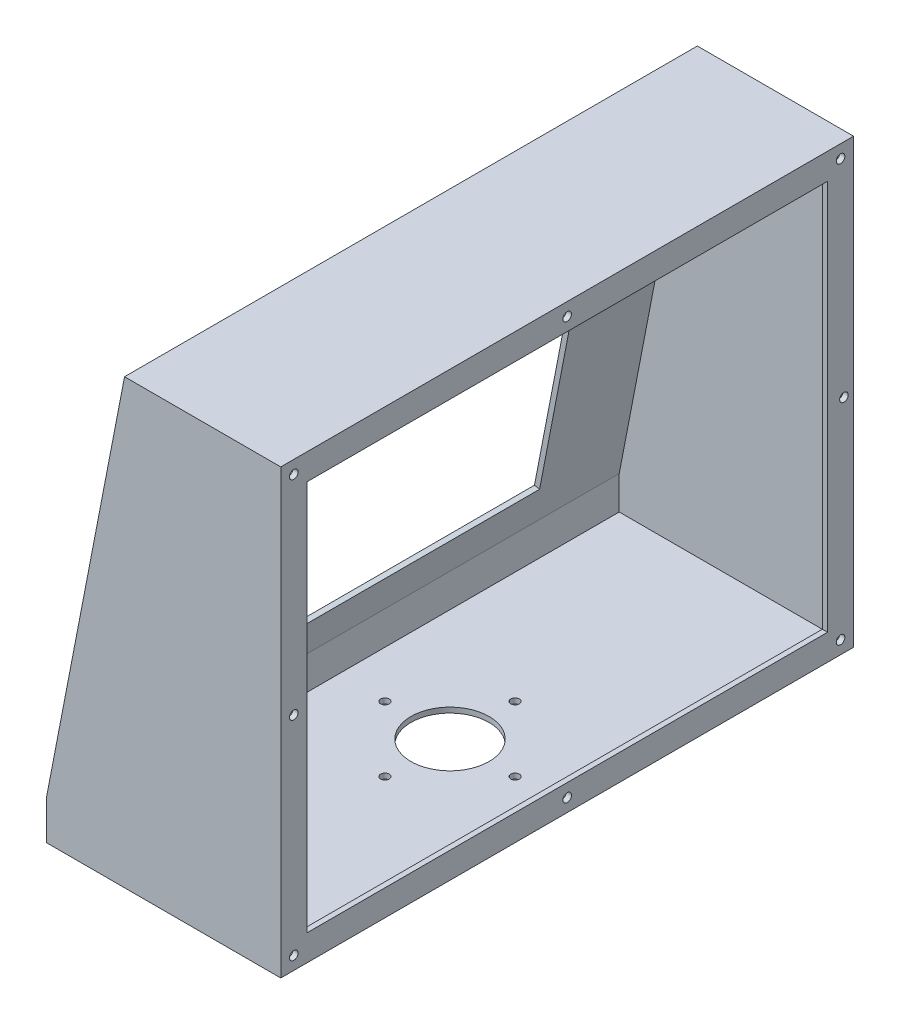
ISO-10303-21;
HEADER;
FILE_DESCRIPTION(('STEP AP214'),'2;1');
FILE_NAME('part.step','',(''),(''),'','','');
FILE_SCHEMA(('AUTOMOTIVE_DESIGN { 1 0 10303 214 1 1 1 1 }'));
ENDSEC;
DATA;
#1=APPLICATION_CONTEXT('core data for automotive mechanical design processes');
#2=APPLICATION_PROTOCOL_DEFINITION('international standard','automotive_design',2000,#1);
#3=PRODUCT_CONTEXT('',#1,'mechanical');
#4=PRODUCT('Part','Part','',(#3));
#5=PRODUCT_RELATED_PRODUCT_CATEGORY('part','',(#4));
#6=PRODUCT_DEFINITION_FORMATION('','',#4);
#7=PRODUCT_DEFINITION_CONTEXT('part definition',#1,'design');
#8=PRODUCT_DEFINITION('design','',#6,#7);
#9=PRODUCT_DEFINITION_SHAPE('','',#8);
#10=(LENGTH_UNIT() NAMED_UNIT(*) SI_UNIT(.MILLI.,.METRE.));
#11=(NAMED_UNIT(*) PLANE_ANGLE_UNIT() SI_UNIT($,.RADIAN.));
#12=(NAMED_UNIT(*) SI_UNIT($,.STERADIAN.) SOLID_ANGLE_UNIT());
#13=UNCERTAINTY_MEASURE_WITH_UNIT(LENGTH_MEASURE(1.E-05),#10,'distance_accuracy_value','');
#14=(GEOMETRIC_REPRESENTATION_CONTEXT(3) GLOBAL_UNCERTAINTY_ASSIGNED_CONTEXT((#13)) GLOBAL_UNIT_ASSIGNED_CONTEXT((#10,
#11,#12)) REPRESENTATION_CONTEXT('',''));
#15=CARTESIAN_POINT('',(0.,0.,0.));
#16=DIRECTION('',(0.,0.,1.));
#17=DIRECTION('',(1.,0.,0.));
#18=AXIS2_PLACEMENT_3D('',#15,#16,#17);
#19=CARTESIAN_POINT('',(0.,-10.,210.));
#20=DIRECTION('',(0.,0.,1.));
#21=DIRECTION('',(0.,-1.,0.));
#22=AXIS2_PLACEMENT_3D('',#19,#20,#21);
#23=PLANE('',#22);
#24=DIRECTION('',(0.,-1.,0.));
#25=VECTOR('',#24,1.);
#26=CARTESIAN_POINT('',(58.,-10.,210.));
#27=LINE('',#26,#25);
#28=CARTESIAN_POINT('',(58.,-10.,210.));
#29=VERTEX_POINT('',#28);
#30=CARTESIAN_POINT('',(58.,-160.,210.));
#31=VERTEX_POINT('',#30);
#32=EDGE_CURVE('E175',#29,#31,#27,.T.);
#33=ORIENTED_EDGE('',*,*,#32,.F.);
#34=DIRECTION('',(1.,0.,0.));
#35=VECTOR('',#34,1.);
#36=CARTESIAN_POINT('',(0.,-10.,210.));
#37=LINE('',#36,#35);
#38=CARTESIAN_POINT('',(60.,-10.,210.));
#39=VERTEX_POINT('',#38);
#40=EDGE_CURVE('E255',#29,#39,#37,.T.);
#41=ORIENTED_EDGE('',*,*,#40,.T.);
#42=DIRECTION('',(0.,-1.,0.));
#43=VECTOR('',#42,1.);
#44=CARTESIAN_POINT('',(60.,-10.,210.));
#45=LINE('',#44,#43);
#46=CARTESIAN_POINT('',(60.,-160.,210.));
#47=VERTEX_POINT('',#46);
#48=EDGE_CURVE('E206',#39,#47,#45,.T.);
#49=ORIENTED_EDGE('',*,*,#48,.T.);
#50=DIRECTION('',(1.,0.,0.));
#51=VECTOR('',#50,1.);
#52=CARTESIAN_POINT('',(0.,-160.,210.));
#53=LINE('',#52,#51);
#54=EDGE_CURVE('E254',#31,#47,#53,.T.);
#55=ORIENTED_EDGE('',*,*,#54,.F.);
#56=EDGE_LOOP('',(#33,#41,#49,#55));
#57=FACE_BOUND('',#56,.T.);
#58=ADVANCED_FACE('F34',(#57),#23,.F.);
#59=CARTESIAN_POINT('',(0.,-10.,210.));
#60=DIRECTION('',(0.,1.,0.));
#61=DIRECTION('',(0.,0.,1.));
#62=AXIS2_PLACEMENT_3D('',#59,#60,#61);
#63=PLANE('',#62);
#64=DIRECTION('',(0.,0.,1.));
#65=VECTOR('',#64,1.);
#66=CARTESIAN_POINT('',(58.,-10.,210.));
#67=LINE('',#66,#65);
#68=CARTESIAN_POINT('',(58.,-10.,9.99999999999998));
#69=VERTEX_POINT('',#68);
#70=EDGE_CURVE('E202',#69,#29,#67,.T.);
#71=ORIENTED_EDGE('',*,*,#70,.F.);
#72=DIRECTION('',(1.,0.,0.));
#73=VECTOR('',#72,1.);
#74=CARTESIAN_POINT('',(0.,-10.,9.99999999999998));
#75=LINE('',#74,#73);
#76=CARTESIAN_POINT('',(60.,-10.,9.99999999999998));
#77=VERTEX_POINT('',#76);
#78=EDGE_CURVE('E258',#69,#77,#75,.T.);
#79=ORIENTED_EDGE('',*,*,#78,.T.);
#80=DIRECTION('',(0.,0.,1.));
#81=VECTOR('',#80,1.);
#82=CARTESIAN_POINT('',(60.,-10.,210.));
#83=LINE('',#82,#81);
#84=EDGE_CURVE('E251',#77,#39,#83,.T.);
#85=ORIENTED_EDGE('',*,*,#84,.T.);
#86=ORIENTED_EDGE('',*,*,#40,.F.);
#87=EDGE_LOOP('',(#71,#79,#85,#86));
#88=FACE_BOUND('',#87,.T.);
#89=ADVANCED_FACE('F394',(#88),#63,.F.);
#90=CARTESIAN_POINT('',(0.,-10.,9.99999999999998));
#91=DIRECTION('',(0.,0.,-1.));
#92=DIRECTION('',(0.,1.,0.));
#93=AXIS2_PLACEMENT_3D('',#90,#91,#92);
#94=PLANE('',#93);
#95=DIRECTION('',(0.,1.,0.));
#96=VECTOR('',#95,1.);
#97=CARTESIAN_POINT('',(58.,-10.,9.99999999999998));
#98=LINE('',#97,#96);
#99=CARTESIAN_POINT('',(58.,-160.,9.99999999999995));
#100=VERTEX_POINT('',#99);
#101=EDGE_CURVE('E239',#100,#69,#98,.T.);
#102=ORIENTED_EDGE('',*,*,#101,.F.);
#103=DIRECTION('',(1.,0.,0.));
#104=VECTOR('',#103,1.);
#105=CARTESIAN_POINT('',(0.,-160.,9.99999999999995));
#106=LINE('',#105,#104);
#107=CARTESIAN_POINT('',(60.,-160.,9.99999999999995));
#108=VERTEX_POINT('',#107);
#109=EDGE_CURVE('E260',#100,#108,#106,.T.);
#110=ORIENTED_EDGE('',*,*,#109,.T.);
#111=DIRECTION('',(0.,1.,0.));
#112=VECTOR('',#111,1.);
#113=CARTESIAN_POINT('',(60.,-10.,9.99999999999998));
#114=LINE('',#113,#112);
#115=EDGE_CURVE('E248',#108,#77,#114,.T.);
#116=ORIENTED_EDGE('',*,*,#115,.T.);
#117=ORIENTED_EDGE('',*,*,#78,.F.);
#118=EDGE_LOOP('',(#102,#110,#116,#117));
#119=FACE_BOUND('',#118,.T.);
#120=ADVANCED_FACE('F400',(#119),#94,.F.);
#121=CARTESIAN_POINT('',(0.,-160.,210.));
#122=DIRECTION('',(0.,-1.,0.));
#123=DIRECTION('',(0.,0.,-1.));
#124=AXIS2_PLACEMENT_3D('',#121,#122,#123);
#125=PLANE('',#124);
#126=DIRECTION('',(0.,0.,-1.));
#127=VECTOR('',#126,1.);
#128=CARTESIAN_POINT('',(58.,-160.,210.));
#129=LINE('',#128,#127);
#130=EDGE_CURVE('E237',#31,#100,#129,.T.);
#131=ORIENTED_EDGE('',*,*,#130,.F.);
#132=ORIENTED_EDGE('',*,*,#54,.T.);
#133=DIRECTION('',(0.,0.,-1.));
#134=VECTOR('',#133,1.);
#135=CARTESIAN_POINT('',(60.,-160.,210.));
#136=LINE('',#135,#134);
#137=EDGE_CURVE('E245',#47,#108,#136,.T.);
#138=ORIENTED_EDGE('',*,*,#137,.T.);
#139=ORIENTED_EDGE('',*,*,#109,.F.);
#140=EDGE_LOOP('',(#131,#132,#138,#139));
#141=FACE_BOUND('',#140,.T.);
#142=ADVANCED_FACE('F391',(#141),#125,.F.);
#143=CARTESIAN_POINT('',(60.,0.,220.));
#144=DIRECTION('',(0.,-1.,0.));
#145=DIRECTION('',(1.,0.,0.));
#146=AXIS2_PLACEMENT_3D('',#143,#144,#145);
#147=PLANE('',#146);
#148=DIRECTION('',(-1.,0.,0.));
#149=VECTOR('',#148,1.);
#150=CARTESIAN_POINT('',(60.,0.,0.));
#151=LINE('',#150,#149);
#152=CARTESIAN_POINT('',(60.,0.,0.));
#153=VERTEX_POINT('',#152);
#154=CARTESIAN_POINT('',(0.,0.,0.));
#155=VERTEX_POINT('',#154);
#156=EDGE_CURVE('E257',#153,#155,#151,.T.);
#157=ORIENTED_EDGE('',*,*,#156,.T.);
#158=DIRECTION('',(0.,0.,-1.));
#159=VECTOR('',#158,1.);
#160=CARTESIAN_POINT('',(0.,0.,220.));
#161=LINE('',#160,#159);
#162=CARTESIAN_POINT('',(0.,0.,220.));
#163=VERTEX_POINT('',#162);
#164=EDGE_CURVE('E11',#163,#155,#161,.T.);
#165=ORIENTED_EDGE('',*,*,#164,.F.);
#166=DIRECTION('',(-1.,0.,0.));
#167=VECTOR('',#166,1.);
#168=CARTESIAN_POINT('',(60.,0.,220.));
#169=LINE('',#168,#167);
#170=CARTESIAN_POINT('',(60.,0.,220.));
#171=VERTEX_POINT('',#170);
#172=EDGE_CURVE('E263',#171,#163,#169,.T.);
#173=ORIENTED_EDGE('',*,*,#172,.F.);
#174=DIRECTION('',(0.,0.,-1.));
#175=VECTOR('',#174,1.);
#176=CARTESIAN_POINT('',(60.,0.,220.));
#177=LINE('',#176,#175);
#178=EDGE_CURVE('E275',#171,#153,#177,.T.);
#179=ORIENTED_EDGE('',*,*,#178,.T.);
#180=EDGE_LOOP('',(#157,#165,#173,#179));
#181=FACE_BOUND('',#180,.T.);
#182=ADVANCED_FACE('F36',(#181),#147,.F.);
#183=CARTESIAN_POINT('',(0.,0.,220.));
#184=DIRECTION('',(0.981779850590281,-0.190021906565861,0.));
#185=DIRECTION('',(0.190021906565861,0.981779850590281,0.));
#186=AXIS2_PLACEMENT_3D('',#183,#184,#185);
#187=PLANE('',#186);
#188=CARTESIAN_POINT('',(-5.70065719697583,-29.4533955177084,15.));
#189=DIRECTION('',(0.981779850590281,-0.190021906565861,0.));
#190=DIRECTION('',(0.190021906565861,0.981779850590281,0.));
#191=AXIS2_PLACEMENT_3D('',#188,#189,#190);
#192=CIRCLE('',#191,8.00000000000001);
#193=CARTESIAN_POINT('',(-4.18048194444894,-21.5991567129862,15.));
#194=VERTEX_POINT('',#193);
#195=EDGE_CURVE('E376',#194,#194,#192,.F.);
#196=ORIENTED_EDGE('',*,*,#195,.F.);
#197=EDGE_LOOP('',(#196));
#198=FACE_BOUND('',#197,.T.);
#199=DIRECTION('',(0.,0.,1.));
#200=VECTOR('',#199,1.);
#201=CARTESIAN_POINT('',(-27.5531764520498,-142.358078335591,35.));
#202=LINE('',#201,#200);
#203=CARTESIAN_POINT('',(-27.5531764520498,-142.358078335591,35.));
#204=VERTEX_POINT('',#203);
#205=CARTESIAN_POINT('',(-27.5531764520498,-142.358078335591,192.));
#206=VERTEX_POINT('',#205);
#207=EDGE_CURVE('E181',#204,#206,#202,.T.);
#208=ORIENTED_EDGE('',*,*,#207,.F.);
#209=DIRECTION('',(-0.190021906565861,-0.981779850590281,0.));
#210=VECTOR('',#209,1.);
#211=CARTESIAN_POINT('',(-3.80043813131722,-19.6355970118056,35.));
#212=LINE('',#211,#210);
#213=CARTESIAN_POINT('',(-3.80043813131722,-19.6355970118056,35.));
#214=VERTEX_POINT('',#213);
#215=EDGE_CURVE('E163',#214,#204,#212,.T.);
#216=ORIENTED_EDGE('',*,*,#215,.F.);
#217=DIRECTION('',(0.,0.,-1.));
#218=VECTOR('',#217,1.);
#219=CARTESIAN_POINT('',(-3.80043813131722,-19.6355970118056,35.));
#220=LINE('',#219,#218);
#221=CARTESIAN_POINT('',(-3.80043813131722,-19.6355970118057,192.));
#222=VERTEX_POINT('',#221);
#223=EDGE_CURVE('E172',#222,#214,#220,.T.);
#224=ORIENTED_EDGE('',*,*,#223,.F.);
#225=DIRECTION('',(0.190021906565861,0.981779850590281,0.));
#226=VECTOR('',#225,1.);
#227=CARTESIAN_POINT('',(-3.80043813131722,-19.6355970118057,192.));
#228=LINE('',#227,#226);
#229=EDGE_CURVE('E51',#206,#222,#228,.T.);
#230=ORIENTED_EDGE('',*,*,#229,.F.);
#231=EDGE_LOOP('',(#208,#216,#224,#230));
#232=FACE_BOUND('',#231,.T.);
#233=DIRECTION('',(-0.190021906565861,-0.981779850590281,0.));
#234=VECTOR('',#233,1.);
#235=CARTESIAN_POINT('',(0.,0.,0.));
#236=LINE('',#235,#234);
#237=CARTESIAN_POINT('',(-30.,-155.,0.));
#238=VERTEX_POINT('',#237);
#239=EDGE_CURVE('E278',#155,#238,#236,.T.);
#240=ORIENTED_EDGE('',*,*,#239,.T.);
#241=DIRECTION('',(0.,0.,-1.));
#242=VECTOR('',#241,1.);
#243=CARTESIAN_POINT('',(-30.,-155.,220.));
#244=LINE('',#243,#242);
#245=CARTESIAN_POINT('',(-30.,-155.,220.));
#246=VERTEX_POINT('',#245);
#247=EDGE_CURVE('E43',#246,#238,#244,.T.);
#248=ORIENTED_EDGE('',*,*,#247,.F.);
#249=DIRECTION('',(-0.190021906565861,-0.981779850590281,0.));
#250=VECTOR('',#249,1.);
#251=CARTESIAN_POINT('',(0.,0.,220.));
#252=LINE('',#251,#250);
#253=EDGE_CURVE('E266',#163,#246,#252,.T.);
#254=ORIENTED_EDGE('',*,*,#253,.F.);
#255=ORIENTED_EDGE('',*,*,#164,.T.);
#256=EDGE_LOOP('',(#240,#248,#254,#255));
#257=FACE_BOUND('',#256,.T.);
#258=ADVANCED_FACE('F178',(#198,#232,#257),#187,.F.);
#259=CARTESIAN_POINT('',(-30.,-155.,220.));
#260=DIRECTION('',(1.,0.,0.));
#261=DIRECTION('',(0.,1.,0.));
#262=AXIS2_PLACEMENT_3D('',#259,#260,#261);
#263=PLANE('',#262);
#264=DIRECTION('',(0.,-1.,0.));
#265=VECTOR('',#264,1.);
#266=CARTESIAN_POINT('',(-30.,-155.,0.));
#267=LINE('',#266,#265);
#268=CARTESIAN_POINT('',(-30.,-170.,0.));
#269=VERTEX_POINT('',#268);
#270=EDGE_CURVE('E280',#238,#269,#267,.T.);
#271=ORIENTED_EDGE('',*,*,#270,.T.);
#272=DIRECTION('',(0.,0.,-1.));
#273=VECTOR('',#272,1.);
#274=CARTESIAN_POINT('',(-30.,-170.,220.));
#275=LINE('',#274,#273);
#276=CARTESIAN_POINT('',(-30.,-170.,220.));
#277=VERTEX_POINT('',#276);
#278=EDGE_CURVE('E290',#277,#269,#275,.T.);
#279=ORIENTED_EDGE('',*,*,#278,.F.);
#280=DIRECTION('',(0.,-1.,0.));
#281=VECTOR('',#280,1.);
#282=CARTESIAN_POINT('',(-30.,-155.,220.));
#283=LINE('',#282,#281);
#284=EDGE_CURVE('E269',#246,#277,#283,.T.);
#285=ORIENTED_EDGE('',*,*,#284,.F.);
#286=ORIENTED_EDGE('',*,*,#247,.T.);
#287=EDGE_LOOP('',(#271,#279,#285,#286));
#288=FACE_BOUND('',#287,.T.);
#289=ADVANCED_FACE('F383',(#288),#263,.F.);
#290=CARTESIAN_POINT('',(-30.,-170.,220.));
#291=DIRECTION('',(0.,1.,0.));
#292=DIRECTION('',(0.,0.,1.));
#293=AXIS2_PLACEMENT_3D('',#290,#291,#292);
#294=PLANE('',#293);
#295=CARTESIAN_POINT('',(-10.,-170.,110.));
#296=DIRECTION('',(0.,1.,0.));
#297=DIRECTION('',(0.,0.,1.));
#298=AXIS2_PLACEMENT_3D('',#295,#296,#297);
#299=CIRCLE('',#298,1.65);
#300=CARTESIAN_POINT('',(-10.,-170.,111.65));
#301=VERTEX_POINT('',#300);
#302=EDGE_CURVE('E346',#301,#301,#299,.T.);
#303=ORIENTED_EDGE('',*,*,#302,.T.);
#304=EDGE_LOOP('',(#303));
#305=FACE_BOUND('',#304,.T.);
#306=CARTESIAN_POINT('',(15.,-170.,135.));
#307=DIRECTION('',(0.,1.,0.));
#308=DIRECTION('',(0.,0.,1.));
#309=AXIS2_PLACEMENT_3D('',#306,#307,#308);
#310=CIRCLE('',#309,1.65);
#311=CARTESIAN_POINT('',(15.,-170.,136.65));
#312=VERTEX_POINT('',#311);
#313=EDGE_CURVE('E352',#312,#312,#310,.T.);
#314=ORIENTED_EDGE('',*,*,#313,.T.);
#315=EDGE_LOOP('',(#314));
#316=FACE_BOUND('',#315,.T.);
#317=CARTESIAN_POINT('',(15.,-170.,85.));
#318=DIRECTION('',(0.,1.,0.));
#319=DIRECTION('',(0.,0.,1.));
#320=AXIS2_PLACEMENT_3D('',#317,#318,#319);
#321=CIRCLE('',#320,1.65);
#322=CARTESIAN_POINT('',(15.,-170.,86.65));
#323=VERTEX_POINT('',#322);
#324=EDGE_CURVE('E358',#323,#323,#321,.T.);
#325=ORIENTED_EDGE('',*,*,#324,.T.);
#326=EDGE_LOOP('',(#325));
#327=FACE_BOUND('',#326,.T.);
#328=CARTESIAN_POINT('',(40.,-170.,110.));
#329=DIRECTION('',(0.,1.,0.));
#330=DIRECTION('',(0.,0.,1.));
#331=AXIS2_PLACEMENT_3D('',#328,#329,#330);
#332=CIRCLE('',#331,1.65);
#333=CARTESIAN_POINT('',(40.,-170.,111.65));
#334=VERTEX_POINT('',#333);
#335=EDGE_CURVE('E364',#334,#334,#332,.T.);
#336=ORIENTED_EDGE('',*,*,#335,.T.);
#337=EDGE_LOOP('',(#336));
#338=FACE_BOUND('',#337,.T.);
#339=CARTESIAN_POINT('',(15.,-170.,110.));
#340=DIRECTION('',(0.,-1.,0.));
#341=DIRECTION('',(0.,0.,-1.));
#342=AXIS2_PLACEMENT_3D('',#339,#340,#341);
#343=CIRCLE('',#342,15.);
#344=CARTESIAN_POINT('',(15.,-170.,95.));
#345=VERTEX_POINT('',#344);
#346=EDGE_CURVE('E367',#345,#345,#343,.T.);
#347=ORIENTED_EDGE('',*,*,#346,.F.);
#348=EDGE_LOOP('',(#347));
#349=FACE_BOUND('',#348,.T.);
#350=DIRECTION('',(1.,0.,0.));
#351=VECTOR('',#350,1.);
#352=CARTESIAN_POINT('',(-30.,-170.,0.));
#353=LINE('',#352,#351);
#354=CARTESIAN_POINT('',(60.,-170.,0.));
#355=VERTEX_POINT('',#354);
#356=EDGE_CURVE('E282',#269,#355,#353,.T.);
#357=ORIENTED_EDGE('',*,*,#356,.T.);
#358=DIRECTION('',(0.,0.,-1.));
#359=VECTOR('',#358,1.);
#360=CARTESIAN_POINT('',(60.,-170.,220.));
#361=LINE('',#360,#359);
#362=CARTESIAN_POINT('',(60.,-170.,220.));
#363=VERTEX_POINT('',#362);
#364=EDGE_CURVE('E287',#363,#355,#361,.T.);
#365=ORIENTED_EDGE('',*,*,#364,.F.);
#366=DIRECTION('',(1.,0.,0.));
#367=VECTOR('',#366,1.);
#368=CARTESIAN_POINT('',(-30.,-170.,220.));
#369=LINE('',#368,#367);
#370=EDGE_CURVE('E271',#277,#363,#369,.T.);
#371=ORIENTED_EDGE('',*,*,#370,.F.);
#372=ORIENTED_EDGE('',*,*,#278,.T.);
#373=EDGE_LOOP('',(#357,#365,#371,#372));
#374=FACE_BOUND('',#373,.T.);
#375=ADVANCED_FACE('F388',(#305,#316,#327,#338,#349,#374),#294,.F.);
#376=CARTESIAN_POINT('',(60.,-170.,220.));
#377=DIRECTION('',(-1.,0.,0.));
#378=DIRECTION('',(0.,0.,1.));
#379=AXIS2_PLACEMENT_3D('',#376,#377,#378);
#380=PLANE('',#379);
#381=CARTESIAN_POINT('',(60.,-5.,215.));
#382=DIRECTION('',(1.,0.,0.));
#383=DIRECTION('',(0.,0.,-1.));
#384=AXIS2_PLACEMENT_3D('',#381,#382,#383);
#385=CIRCLE('',#384,1.65);
#386=CARTESIAN_POINT('',(60.,-5.,213.35));
#387=VERTEX_POINT('',#386);
#388=EDGE_CURVE('E311',#387,#387,#385,.T.);
#389=ORIENTED_EDGE('',*,*,#388,.F.);
#390=EDGE_LOOP('',(#389));
#391=FACE_BOUND('',#390,.T.);
#392=CARTESIAN_POINT('',(60.,-85.,215.));
#393=DIRECTION('',(1.,0.,0.));
#394=DIRECTION('',(0.,0.,-1.));
#395=AXIS2_PLACEMENT_3D('',#392,#393,#394);
#396=CIRCLE('',#395,1.65);
#397=CARTESIAN_POINT('',(60.,-85.,213.35));
#398=VERTEX_POINT('',#397);
#399=EDGE_CURVE('E301',#398,#398,#396,.T.);
#400=ORIENTED_EDGE('',*,*,#399,.F.);
#401=EDGE_LOOP('',(#400));
#402=FACE_BOUND('',#401,.T.);
#403=CARTESIAN_POINT('',(60.,-165.,215.));
#404=DIRECTION('',(1.,0.,0.));
#405=DIRECTION('',(0.,0.,-1.));
#406=AXIS2_PLACEMENT_3D('',#403,#404,#405);
#407=CIRCLE('',#406,1.64999999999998);
#408=CARTESIAN_POINT('',(60.,-165.,213.35));
#409=VERTEX_POINT('',#408);
#410=EDGE_CURVE('E298',#409,#409,#407,.T.);
#411=ORIENTED_EDGE('',*,*,#410,.F.);
#412=EDGE_LOOP('',(#411));
#413=FACE_BOUND('',#412,.T.);
#414=CARTESIAN_POINT('',(60.,-165.,110.));
#415=DIRECTION('',(1.,0.,0.));
#416=DIRECTION('',(0.,0.,-1.));
#417=AXIS2_PLACEMENT_3D('',#414,#415,#416);
#418=CIRCLE('',#417,1.64999999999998);
#419=CARTESIAN_POINT('',(60.,-165.,108.35));
#420=VERTEX_POINT('',#419);
#421=EDGE_CURVE('E297',#420,#420,#418,.T.);
#422=ORIENTED_EDGE('',*,*,#421,.F.);
#423=EDGE_LOOP('',(#422));
#424=FACE_BOUND('',#423,.T.);
#425=CARTESIAN_POINT('',(60.,-165.,5.));
#426=DIRECTION('',(1.,0.,0.));
#427=DIRECTION('',(0.,0.,-1.));
#428=AXIS2_PLACEMENT_3D('',#425,#426,#427);
#429=CIRCLE('',#428,1.64999999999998);
#430=CARTESIAN_POINT('',(60.,-165.,3.35000000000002));
#431=VERTEX_POINT('',#430);
#432=EDGE_CURVE('E319',#431,#431,#429,.T.);
#433=ORIENTED_EDGE('',*,*,#432,.F.);
#434=EDGE_LOOP('',(#433));
#435=FACE_BOUND('',#434,.T.);
#436=CARTESIAN_POINT('',(60.,-85.,3.69391633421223));
#437=DIRECTION('',(1.,0.,0.));
#438=DIRECTION('',(0.,0.,-1.));
#439=AXIS2_PLACEMENT_3D('',#436,#437,#438);
#440=CIRCLE('',#439,1.65);
#441=CARTESIAN_POINT('',(60.,-85.,2.04391633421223));
#442=VERTEX_POINT('',#441);
#443=EDGE_CURVE('E325',#442,#442,#440,.T.);
#444=ORIENTED_EDGE('',*,*,#443,.F.);
#445=EDGE_LOOP('',(#444));
#446=FACE_BOUND('',#445,.T.);
#447=CARTESIAN_POINT('',(60.,-5.,5.));
#448=DIRECTION('',(1.,0.,0.));
#449=DIRECTION('',(0.,0.,-1.));
#450=AXIS2_PLACEMENT_3D('',#447,#448,#449);
#451=CIRCLE('',#450,1.65);
#452=CARTESIAN_POINT('',(60.,-5.,3.35000000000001));
#453=VERTEX_POINT('',#452);
#454=EDGE_CURVE('E331',#453,#453,#451,.T.);
#455=ORIENTED_EDGE('',*,*,#454,.F.);
#456=EDGE_LOOP('',(#455));
#457=FACE_BOUND('',#456,.T.);
#458=CARTESIAN_POINT('',(60.,-5.,110.));
#459=DIRECTION('',(1.,0.,0.));
#460=DIRECTION('',(0.,0.,-1.));
#461=AXIS2_PLACEMENT_3D('',#458,#459,#460);
#462=CIRCLE('',#461,1.65);
#463=CARTESIAN_POINT('',(60.,-5.,108.35));
#464=VERTEX_POINT('',#463);
#465=EDGE_CURVE('E337',#464,#464,#462,.T.);
#466=ORIENTED_EDGE('',*,*,#465,.F.);
#467=EDGE_LOOP('',(#466));
#468=FACE_BOUND('',#467,.T.);
#469=ORIENTED_EDGE('',*,*,#137,.F.);
#470=ORIENTED_EDGE('',*,*,#48,.F.);
#471=ORIENTED_EDGE('',*,*,#84,.F.);
#472=ORIENTED_EDGE('',*,*,#115,.F.);
#473=EDGE_LOOP('',(#469,#470,#471,#472));
#474=FACE_BOUND('',#473,.T.);
#475=DIRECTION('',(0.,1.,0.));
#476=VECTOR('',#475,1.);
#477=CARTESIAN_POINT('',(60.,-170.,0.));
#478=LINE('',#477,#476);
#479=EDGE_CURVE('E267',#355,#153,#478,.T.);
#480=ORIENTED_EDGE('',*,*,#479,.T.);
#481=ORIENTED_EDGE('',*,*,#178,.F.);
#482=DIRECTION('',(0.,1.,0.));
#483=VECTOR('',#482,1.);
#484=CARTESIAN_POINT('',(60.,-170.,220.));
#485=LINE('',#484,#483);
#486=EDGE_CURVE('E273',#363,#171,#485,.T.);
#487=ORIENTED_EDGE('',*,*,#486,.F.);
#488=ORIENTED_EDGE('',*,*,#364,.T.);
#489=EDGE_LOOP('',(#480,#481,#487,#488));
#490=FACE_BOUND('',#489,.T.);
#491=ADVANCED_FACE('F411',(#391,#402,#413,#424,#435,#446,#457,#468,#474,#490),#380,.F.);
#492=CARTESIAN_POINT('',(-30.,0.,220.));
#493=DIRECTION('',(0.,0.,1.));
#494=DIRECTION('',(1.,0.,0.));
#495=AXIS2_PLACEMENT_3D('',#492,#493,#494);
#496=PLANE('',#495);
#497=ORIENTED_EDGE('',*,*,#172,.T.);
#498=ORIENTED_EDGE('',*,*,#253,.T.);
#499=ORIENTED_EDGE('',*,*,#284,.T.);
#500=ORIENTED_EDGE('',*,*,#370,.T.);
#501=ORIENTED_EDGE('',*,*,#486,.T.);
#502=EDGE_LOOP('',(#497,#498,#499,#500,#501));
#503=FACE_BOUND('',#502,.T.);
#504=ADVANCED_FACE('F407',(#503),#496,.T.);
#505=CARTESIAN_POINT('',(-30.,0.,0.));
#506=DIRECTION('',(0.,0.,1.));
#507=DIRECTION('',(1.,0.,0.));
#508=AXIS2_PLACEMENT_3D('',#505,#506,#507);
#509=PLANE('',#508);
#510=ORIENTED_EDGE('',*,*,#156,.F.);
#511=ORIENTED_EDGE('',*,*,#479,.F.);
#512=ORIENTED_EDGE('',*,*,#356,.F.);
#513=ORIENTED_EDGE('',*,*,#270,.F.);
#514=ORIENTED_EDGE('',*,*,#239,.F.);
#515=EDGE_LOOP('',(#510,#511,#512,#513,#514));
#516=FACE_BOUND('',#515,.T.);
#517=ADVANCED_FACE('F410',(#516),#509,.F.);
#518=CARTESIAN_POINT('',(60.,-2.,220.));
#519=DIRECTION('',(0.,-1.,0.));
#520=DIRECTION('',(1.,0.,0.));
#521=AXIS2_PLACEMENT_3D('',#518,#519,#520);
#522=PLANE('',#521);
#523=DIRECTION('',(-1.,0.,0.));
#524=VECTOR('',#523,1.);
#525=CARTESIAN_POINT('',(60.,-2.,2.));
#526=LINE('',#525,#524);
#527=CARTESIAN_POINT('',(58.,-2.,2.));
#528=VERTEX_POINT('',#527);
#529=CARTESIAN_POINT('',(1.65001979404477,-2.,2.));
#530=VERTEX_POINT('',#529);
#531=EDGE_CURVE('E198',#528,#530,#526,.T.);
#532=ORIENTED_EDGE('',*,*,#531,.F.);
#533=DIRECTION('',(0.,0.,-1.));
#534=VECTOR('',#533,1.);
#535=CARTESIAN_POINT('',(58.,-2.,220.));
#536=LINE('',#535,#534);
#537=CARTESIAN_POINT('',(58.,-2.,218.));
#538=VERTEX_POINT('',#537);
#539=EDGE_CURVE('E213',#538,#528,#536,.T.);
#540=ORIENTED_EDGE('',*,*,#539,.F.);
#541=DIRECTION('',(-1.,0.,0.));
#542=VECTOR('',#541,1.);
#543=CARTESIAN_POINT('',(60.,-2.,218.));
#544=LINE('',#543,#542);
#545=CARTESIAN_POINT('',(1.65001979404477,-2.,218.));
#546=VERTEX_POINT('',#545);
#547=EDGE_CURVE('E208',#538,#546,#544,.T.);
#548=ORIENTED_EDGE('',*,*,#547,.T.);
#549=DIRECTION('',(0.,0.,-1.));
#550=VECTOR('',#549,1.);
#551=CARTESIAN_POINT('',(1.65001979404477,-2.,220.));
#552=LINE('',#551,#550);
#553=EDGE_CURVE('E203',#546,#530,#552,.T.);
#554=ORIENTED_EDGE('',*,*,#553,.T.);
#555=EDGE_LOOP('',(#532,#540,#548,#554));
#556=FACE_BOUND('',#555,.T.);
#557=ADVANCED_FACE('F415',(#556),#522,.T.);
#558=CARTESIAN_POINT('',(1.96355970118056,-0.380043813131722,220.));
#559=DIRECTION('',(0.981779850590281,-0.190021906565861,0.));
#560=DIRECTION('',(0.190021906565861,0.981779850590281,0.));
#561=AXIS2_PLACEMENT_3D('',#558,#559,#560);
#562=PLANE('',#561);
#563=CARTESIAN_POINT('',(-3.73709749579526,-29.8334393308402,15.));
#564=DIRECTION('',(0.981779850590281,-0.190021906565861,0.));
#565=DIRECTION('',(0.190021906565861,0.981779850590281,0.));
#566=AXIS2_PLACEMENT_3D('',#563,#564,#565);
#567=CIRCLE('',#566,8.00000000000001);
#568=CARTESIAN_POINT('',(-2.21692224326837,-21.9792005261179,15.));
#569=VERTEX_POINT('',#568);
#570=EDGE_CURVE('E371',#569,#569,#567,.T.);
#571=ORIENTED_EDGE('',*,*,#570,.F.);
#572=EDGE_LOOP('',(#571));
#573=FACE_BOUND('',#572,.T.);
#574=DIRECTION('',(0.190021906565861,0.981779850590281,0.));
#575=VECTOR('',#574,1.);
#576=CARTESIAN_POINT('',(-1.83687843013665,-20.0156408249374,35.));
#577=LINE('',#576,#575);
#578=CARTESIAN_POINT('',(-25.5896167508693,-142.738122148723,35.));
#579=VERTEX_POINT('',#578);
#580=CARTESIAN_POINT('',(-1.83687843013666,-20.0156408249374,35.));
#581=VERTEX_POINT('',#580);
#582=EDGE_CURVE('E59',#579,#581,#577,.T.);
#583=ORIENTED_EDGE('',*,*,#582,.F.);
#584=DIRECTION('',(0.,0.,-1.));
#585=VECTOR('',#584,1.);
#586=CARTESIAN_POINT('',(-25.5896167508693,-142.738122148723,35.));
#587=LINE('',#586,#585);
#588=CARTESIAN_POINT('',(-25.5896167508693,-142.738122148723,192.));
#589=VERTEX_POINT('',#588);
#590=EDGE_CURVE('E169',#589,#579,#587,.T.);
#591=ORIENTED_EDGE('',*,*,#590,.F.);
#592=DIRECTION('',(-0.190021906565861,-0.981779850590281,0.));
#593=VECTOR('',#592,1.);
#594=CARTESIAN_POINT('',(-1.83687843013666,-20.0156408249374,192.));
#595=LINE('',#594,#593);
#596=CARTESIAN_POINT('',(-1.83687843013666,-20.0156408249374,192.));
#597=VERTEX_POINT('',#596);
#598=EDGE_CURVE('E189',#597,#589,#595,.T.);
#599=ORIENTED_EDGE('',*,*,#598,.F.);
#600=DIRECTION('',(0.,0.,1.));
#601=VECTOR('',#600,1.);
#602=CARTESIAN_POINT('',(-1.83687843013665,-20.0156408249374,35.));
#603=LINE('',#602,#601);
#604=EDGE_CURVE('E183',#581,#597,#603,.T.);
#605=ORIENTED_EDGE('',*,*,#604,.F.);
#606=EDGE_LOOP('',(#583,#591,#599,#605));
#607=FACE_BOUND('',#606,.T.);
#608=DIRECTION('',(-0.190021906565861,-0.981779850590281,0.));
#609=VECTOR('',#608,1.);
#610=CARTESIAN_POINT('',(1.96355970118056,-0.380043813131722,2.));
#611=LINE('',#610,#609);
#612=CARTESIAN_POINT('',(-28.,-155.191768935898,2.));
#613=VERTEX_POINT('',#612);
#614=EDGE_CURVE('E201',#530,#613,#611,.T.);
#615=ORIENTED_EDGE('',*,*,#614,.F.);
#616=ORIENTED_EDGE('',*,*,#553,.F.);
#617=DIRECTION('',(-0.190021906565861,-0.981779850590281,0.));
#618=VECTOR('',#617,1.);
#619=CARTESIAN_POINT('',(1.96355970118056,-0.380043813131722,218.));
#620=LINE('',#619,#618);
#621=CARTESIAN_POINT('',(-28.,-155.191768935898,218.));
#622=VERTEX_POINT('',#621);
#623=EDGE_CURVE('E211',#546,#622,#620,.T.);
#624=ORIENTED_EDGE('',*,*,#623,.T.);
#625=DIRECTION('',(0.,0.,-1.));
#626=VECTOR('',#625,1.);
#627=CARTESIAN_POINT('',(-28.,-155.191768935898,220.));
#628=LINE('',#627,#626);
#629=EDGE_CURVE('E207',#622,#613,#628,.T.);
#630=ORIENTED_EDGE('',*,*,#629,.T.);
#631=EDGE_LOOP('',(#615,#616,#624,#630));
#632=FACE_BOUND('',#631,.T.);
#633=ADVANCED_FACE('F481',(#573,#607,#632),#562,.T.);
#634=CARTESIAN_POINT('',(-28.,-155.,220.));
#635=DIRECTION('',(1.,0.,0.));
#636=DIRECTION('',(0.,1.,0.));
#637=AXIS2_PLACEMENT_3D('',#634,#635,#636);
#638=PLANE('',#637);
#639=DIRECTION('',(0.,-1.,0.));
#640=VECTOR('',#639,1.);
#641=CARTESIAN_POINT('',(-28.,-155.,2.));
#642=LINE('',#641,#640);
#643=CARTESIAN_POINT('',(-28.,-168.,2.));
#644=VERTEX_POINT('',#643);
#645=EDGE_CURVE('E219',#613,#644,#642,.T.);
#646=ORIENTED_EDGE('',*,*,#645,.F.);
#647=ORIENTED_EDGE('',*,*,#629,.F.);
#648=DIRECTION('',(0.,-1.,0.));
#649=VECTOR('',#648,1.);
#650=CARTESIAN_POINT('',(-28.,-155.,218.));
#651=LINE('',#650,#649);
#652=CARTESIAN_POINT('',(-28.,-168.,218.));
#653=VERTEX_POINT('',#652);
#654=EDGE_CURVE('E224',#622,#653,#651,.T.);
#655=ORIENTED_EDGE('',*,*,#654,.T.);
#656=DIRECTION('',(0.,0.,-1.));
#657=VECTOR('',#656,1.);
#658=CARTESIAN_POINT('',(-28.,-168.,220.));
#659=LINE('',#658,#657);
#660=EDGE_CURVE('E222',#653,#644,#659,.T.);
#661=ORIENTED_EDGE('',*,*,#660,.T.);
#662=EDGE_LOOP('',(#646,#647,#655,#661));
#663=FACE_BOUND('',#662,.T.);
#664=ADVANCED_FACE('F485',(#663),#638,.T.);
#665=CARTESIAN_POINT('',(-30.,-168.,220.));
#666=DIRECTION('',(0.,1.,0.));
#667=DIRECTION('',(0.,0.,1.));
#668=AXIS2_PLACEMENT_3D('',#665,#666,#667);
#669=PLANE('',#668);
#670=CARTESIAN_POINT('',(-10.,-168.,110.));
#671=DIRECTION('',(0.,1.,0.));
#672=DIRECTION('',(0.,0.,1.));
#673=AXIS2_PLACEMENT_3D('',#670,#671,#672);
#674=CIRCLE('',#673,1.65);
#675=CARTESIAN_POINT('',(-10.,-168.,111.65));
#676=VERTEX_POINT('',#675);
#677=EDGE_CURVE('E343',#676,#676,#674,.T.);
#678=ORIENTED_EDGE('',*,*,#677,.F.);
#679=EDGE_LOOP('',(#678));
#680=FACE_BOUND('',#679,.T.);
#681=CARTESIAN_POINT('',(15.,-168.,135.));
#682=DIRECTION('',(0.,1.,0.));
#683=DIRECTION('',(0.,0.,1.));
#684=AXIS2_PLACEMENT_3D('',#681,#682,#683);
#685=CIRCLE('',#684,1.65);
#686=CARTESIAN_POINT('',(15.,-168.,136.65));
#687=VERTEX_POINT('',#686);
#688=EDGE_CURVE('E349',#687,#687,#685,.T.);
#689=ORIENTED_EDGE('',*,*,#688,.F.);
#690=EDGE_LOOP('',(#689));
#691=FACE_BOUND('',#690,.T.);
#692=CARTESIAN_POINT('',(15.,-168.,85.));
#693=DIRECTION('',(0.,1.,0.));
#694=DIRECTION('',(0.,0.,1.));
#695=AXIS2_PLACEMENT_3D('',#692,#693,#694);
#696=CIRCLE('',#695,1.65);
#697=CARTESIAN_POINT('',(15.,-168.,86.65));
#698=VERTEX_POINT('',#697);
#699=EDGE_CURVE('E355',#698,#698,#696,.T.);
#700=ORIENTED_EDGE('',*,*,#699,.F.);
#701=EDGE_LOOP('',(#700));
#702=FACE_BOUND('',#701,.T.);
#703=CARTESIAN_POINT('',(40.,-168.,110.));
#704=DIRECTION('',(0.,1.,0.));
#705=DIRECTION('',(0.,0.,1.));
#706=AXIS2_PLACEMENT_3D('',#703,#704,#705);
#707=CIRCLE('',#706,1.65);
#708=CARTESIAN_POINT('',(40.,-168.,111.65));
#709=VERTEX_POINT('',#708);
#710=EDGE_CURVE('E361',#709,#709,#707,.T.);
#711=ORIENTED_EDGE('',*,*,#710,.F.);
#712=EDGE_LOOP('',(#711));
#713=FACE_BOUND('',#712,.T.);
#714=CARTESIAN_POINT('',(15.,-168.,110.));
#715=DIRECTION('',(0.,-1.,0.));
#716=DIRECTION('',(0.,0.,-1.));
#717=AXIS2_PLACEMENT_3D('',#714,#715,#716);
#718=CIRCLE('',#717,15.);
#719=CARTESIAN_POINT('',(15.,-168.,95.));
#720=VERTEX_POINT('',#719);
#721=EDGE_CURVE('E368',#720,#720,#718,.T.);
#722=ORIENTED_EDGE('',*,*,#721,.T.);
#723=EDGE_LOOP('',(#722));
#724=FACE_BOUND('',#723,.T.);
#725=DIRECTION('',(1.,0.,0.));
#726=VECTOR('',#725,1.);
#727=CARTESIAN_POINT('',(-30.,-168.,2.));
#728=LINE('',#727,#726);
#729=CARTESIAN_POINT('',(58.,-168.,2.));
#730=VERTEX_POINT('',#729);
#731=EDGE_CURVE('E226',#644,#730,#728,.T.);
#732=ORIENTED_EDGE('',*,*,#731,.F.);
#733=ORIENTED_EDGE('',*,*,#660,.F.);
#734=DIRECTION('',(1.,0.,0.));
#735=VECTOR('',#734,1.);
#736=CARTESIAN_POINT('',(-30.,-168.,218.));
#737=LINE('',#736,#735);
#738=CARTESIAN_POINT('',(58.,-168.,218.));
#739=VERTEX_POINT('',#738);
#740=EDGE_CURVE('E230',#653,#739,#737,.T.);
#741=ORIENTED_EDGE('',*,*,#740,.T.);
#742=DIRECTION('',(0.,0.,-1.));
#743=VECTOR('',#742,1.);
#744=CARTESIAN_POINT('',(58.,-168.,220.));
#745=LINE('',#744,#743);
#746=EDGE_CURVE('E216',#739,#730,#745,.T.);
#747=ORIENTED_EDGE('',*,*,#746,.T.);
#748=EDGE_LOOP('',(#732,#733,#741,#747));
#749=FACE_BOUND('',#748,.T.);
#750=ADVANCED_FACE('F489',(#680,#691,#702,#713,#724,#749),#669,.T.);
#751=CARTESIAN_POINT('',(58.,-170.,220.));
#752=DIRECTION('',(-1.,0.,0.));
#753=DIRECTION('',(0.,0.,1.));
#754=AXIS2_PLACEMENT_3D('',#751,#752,#753);
#755=PLANE('',#754);
#756=CARTESIAN_POINT('',(58.,-5.,215.));
#757=DIRECTION('',(-1.,0.,0.));
#758=DIRECTION('',(0.,0.,1.));
#759=AXIS2_PLACEMENT_3D('',#756,#757,#758);
#760=CIRCLE('',#759,1.65);
#761=CARTESIAN_POINT('',(58.,-5.,216.65));
#762=VERTEX_POINT('',#761);
#763=EDGE_CURVE('E38',#762,#762,#760,.T.);
#764=ORIENTED_EDGE('',*,*,#763,.F.);
#765=EDGE_LOOP('',(#764));
#766=FACE_BOUND('',#765,.T.);
#767=CARTESIAN_POINT('',(58.,-85.,215.));
#768=DIRECTION('',(-1.,0.,0.));
#769=DIRECTION('',(0.,0.,1.));
#770=AXIS2_PLACEMENT_3D('',#767,#768,#769);
#771=CIRCLE('',#770,1.65);
#772=CARTESIAN_POINT('',(58.,-85.,216.65));
#773=VERTEX_POINT('',#772);
#774=EDGE_CURVE('E299',#773,#773,#771,.T.);
#775=ORIENTED_EDGE('',*,*,#774,.F.);
#776=EDGE_LOOP('',(#775));
#777=FACE_BOUND('',#776,.T.);
#778=CARTESIAN_POINT('',(58.,-165.,215.));
#779=DIRECTION('',(-1.,0.,0.));
#780=DIRECTION('',(0.,0.,1.));
#781=AXIS2_PLACEMENT_3D('',#778,#779,#780);
#782=CIRCLE('',#781,1.64999999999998);
#783=CARTESIAN_POINT('',(58.,-165.,216.65));
#784=VERTEX_POINT('',#783);
#785=EDGE_CURVE('E295',#784,#784,#782,.T.);
#786=ORIENTED_EDGE('',*,*,#785,.F.);
#787=EDGE_LOOP('',(#786));
#788=FACE_BOUND('',#787,.T.);
#789=CARTESIAN_POINT('',(58.,-165.,110.));
#790=DIRECTION('',(-1.,0.,0.));
#791=DIRECTION('',(0.,0.,1.));
#792=AXIS2_PLACEMENT_3D('',#789,#790,#791);
#793=CIRCLE('',#792,1.64999999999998);
#794=CARTESIAN_POINT('',(58.,-165.,111.65));
#795=VERTEX_POINT('',#794);
#796=EDGE_CURVE('E316',#795,#795,#793,.T.);
#797=ORIENTED_EDGE('',*,*,#796,.F.);
#798=EDGE_LOOP('',(#797));
#799=FACE_BOUND('',#798,.T.);
#800=CARTESIAN_POINT('',(58.,-165.,5.));
#801=DIRECTION('',(-1.,0.,0.));
#802=DIRECTION('',(0.,0.,1.));
#803=AXIS2_PLACEMENT_3D('',#800,#801,#802);
#804=CIRCLE('',#803,1.64999999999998);
#805=CARTESIAN_POINT('',(58.,-165.,6.64999999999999));
#806=VERTEX_POINT('',#805);
#807=EDGE_CURVE('E322',#806,#806,#804,.T.);
#808=ORIENTED_EDGE('',*,*,#807,.F.);
#809=EDGE_LOOP('',(#808));
#810=FACE_BOUND('',#809,.T.);
#811=CARTESIAN_POINT('',(58.,-85.,3.69391633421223));
#812=DIRECTION('',(-1.,0.,0.));
#813=DIRECTION('',(0.,0.,1.));
#814=AXIS2_PLACEMENT_3D('',#811,#812,#813);
#815=CIRCLE('',#814,1.65);
#816=CARTESIAN_POINT('',(58.,-85.,5.34391633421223));
#817=VERTEX_POINT('',#816);
#818=EDGE_CURVE('E328',#817,#817,#815,.T.);
#819=ORIENTED_EDGE('',*,*,#818,.F.);
#820=EDGE_LOOP('',(#819));
#821=FACE_BOUND('',#820,.T.);
#822=CARTESIAN_POINT('',(58.,-5.,5.));
#823=DIRECTION('',(-1.,0.,0.));
#824=DIRECTION('',(0.,0.,1.));
#825=AXIS2_PLACEMENT_3D('',#822,#823,#824);
#826=CIRCLE('',#825,1.65);
#827=CARTESIAN_POINT('',(58.,-5.,6.65));
#828=VERTEX_POINT('',#827);
#829=EDGE_CURVE('E334',#828,#828,#826,.T.);
#830=ORIENTED_EDGE('',*,*,#829,.F.);
#831=EDGE_LOOP('',(#830));
#832=FACE_BOUND('',#831,.T.);
#833=CARTESIAN_POINT('',(58.,-5.,110.));
#834=DIRECTION('',(-1.,0.,0.));
#835=DIRECTION('',(0.,0.,1.));
#836=AXIS2_PLACEMENT_3D('',#833,#834,#835);
#837=CIRCLE('',#836,1.65);
#838=CARTESIAN_POINT('',(58.,-5.,111.65));
#839=VERTEX_POINT('',#838);
#840=EDGE_CURVE('E340',#839,#839,#837,.T.);
#841=ORIENTED_EDGE('',*,*,#840,.F.);
#842=EDGE_LOOP('',(#841));
#843=FACE_BOUND('',#842,.T.);
#844=ORIENTED_EDGE('',*,*,#130,.T.);
#845=ORIENTED_EDGE('',*,*,#101,.T.);
#846=ORIENTED_EDGE('',*,*,#70,.T.);
#847=ORIENTED_EDGE('',*,*,#32,.T.);
#848=EDGE_LOOP('',(#844,#845,#846,#847));
#849=FACE_BOUND('',#848,.T.);
#850=DIRECTION('',(0.,1.,0.));
#851=VECTOR('',#850,1.);
#852=CARTESIAN_POINT('',(58.,-170.,2.));
#853=LINE('',#852,#851);
#854=EDGE_CURVE('E212',#730,#528,#853,.T.);
#855=ORIENTED_EDGE('',*,*,#854,.F.);
#856=ORIENTED_EDGE('',*,*,#746,.F.);
#857=DIRECTION('',(0.,1.,0.));
#858=VECTOR('',#857,1.);
#859=CARTESIAN_POINT('',(58.,-170.,218.));
#860=LINE('',#859,#858);
#861=EDGE_CURVE('E217',#739,#538,#860,.T.);
#862=ORIENTED_EDGE('',*,*,#861,.T.);
#863=ORIENTED_EDGE('',*,*,#539,.T.);
#864=EDGE_LOOP('',(#855,#856,#862,#863));
#865=FACE_BOUND('',#864,.T.);
#866=ADVANCED_FACE('F493',(#766,#777,#788,#799,#810,#821,#832,#843,#849,#865),#755,.T.);
#867=CARTESIAN_POINT('',(-30.,0.,218.));
#868=DIRECTION('',(0.,0.,1.));
#869=DIRECTION('',(1.,0.,0.));
#870=AXIS2_PLACEMENT_3D('',#867,#868,#869);
#871=PLANE('',#870);
#872=ORIENTED_EDGE('',*,*,#547,.F.);
#873=ORIENTED_EDGE('',*,*,#861,.F.);
#874=ORIENTED_EDGE('',*,*,#740,.F.);
#875=ORIENTED_EDGE('',*,*,#654,.F.);
#876=ORIENTED_EDGE('',*,*,#623,.F.);
#877=EDGE_LOOP('',(#872,#873,#874,#875,#876));
#878=FACE_BOUND('',#877,.T.);
#879=ADVANCED_FACE('F497',(#878),#871,.F.);
#880=CARTESIAN_POINT('',(-30.,0.,2.));
#881=DIRECTION('',(0.,0.,1.));
#882=DIRECTION('',(1.,0.,0.));
#883=AXIS2_PLACEMENT_3D('',#880,#881,#882);
#884=PLANE('',#883);
#885=ORIENTED_EDGE('',*,*,#531,.T.);
#886=ORIENTED_EDGE('',*,*,#614,.T.);
#887=ORIENTED_EDGE('',*,*,#645,.T.);
#888=ORIENTED_EDGE('',*,*,#731,.T.);
#889=ORIENTED_EDGE('',*,*,#854,.T.);
#890=EDGE_LOOP('',(#885,#886,#887,#888,#889));
#891=FACE_BOUND('',#890,.T.);
#892=ADVANCED_FACE('F478',(#891),#884,.T.);
#893=CARTESIAN_POINT('',(-32.7183388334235,-14.0385839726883,35.));
#894=DIRECTION('',(0.,0.,-1.));
#895=DIRECTION('',(0.,1.,0.));
#896=AXIS2_PLACEMENT_3D('',#893,#894,#895);
#897=PLANE('',#896);
#898=ORIENTED_EDGE('',*,*,#215,.T.);
#899=DIRECTION('',(0.981779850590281,-0.190021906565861,0.));
#900=VECTOR('',#899,1.);
#901=CARTESIAN_POINT('',(-56.4710771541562,-136.761065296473,35.));
#902=LINE('',#901,#900);
#903=EDGE_CURVE('E176',#204,#579,#902,.T.);
#904=ORIENTED_EDGE('',*,*,#903,.T.);
#905=ORIENTED_EDGE('',*,*,#582,.T.);
#906=DIRECTION('',(0.981779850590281,-0.190021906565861,0.));
#907=VECTOR('',#906,1.);
#908=CARTESIAN_POINT('',(-32.7183388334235,-14.0385839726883,35.));
#909=LINE('',#908,#907);
#910=EDGE_CURVE('E159',#214,#581,#909,.T.);
#911=ORIENTED_EDGE('',*,*,#910,.F.);
#912=EDGE_LOOP('',(#898,#904,#905,#911));
#913=FACE_BOUND('',#912,.T.);
#914=ADVANCED_FACE('F161',(#913),#897,.F.);
#915=CARTESIAN_POINT('',(-56.4710771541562,-136.761065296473,35.));
#916=DIRECTION('',(-0.190021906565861,-0.981779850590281,0.));
#917=DIRECTION('',(0.981779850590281,-0.190021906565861,0.));
#918=AXIS2_PLACEMENT_3D('',#915,#916,#917);
#919=PLANE('',#918);
#920=ORIENTED_EDGE('',*,*,#207,.T.);
#921=DIRECTION('',(0.981779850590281,-0.190021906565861,0.));
#922=VECTOR('',#921,1.);
#923=CARTESIAN_POINT('',(-56.4710771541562,-136.761065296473,192.));
#924=LINE('',#923,#922);
#925=EDGE_CURVE('E195',#206,#589,#924,.T.);
#926=ORIENTED_EDGE('',*,*,#925,.T.);
#927=ORIENTED_EDGE('',*,*,#590,.T.);
#928=ORIENTED_EDGE('',*,*,#903,.F.);
#929=EDGE_LOOP('',(#920,#926,#927,#928));
#930=FACE_BOUND('',#929,.T.);
#931=ADVANCED_FACE('F467',(#930),#919,.F.);
#932=CARTESIAN_POINT('',(-32.7183388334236,-14.0385839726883,192.));
#933=DIRECTION('',(0.,0.,1.));
#934=DIRECTION('',(1.,0.,0.));
#935=AXIS2_PLACEMENT_3D('',#932,#933,#934);
#936=PLANE('',#935);
#937=ORIENTED_EDGE('',*,*,#229,.T.);
#938=DIRECTION('',(0.981779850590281,-0.190021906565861,0.));
#939=VECTOR('',#938,1.);
#940=CARTESIAN_POINT('',(-32.7183388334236,-14.0385839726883,192.));
#941=LINE('',#940,#939);
#942=EDGE_CURVE('E168',#222,#597,#941,.T.);
#943=ORIENTED_EDGE('',*,*,#942,.T.);
#944=ORIENTED_EDGE('',*,*,#598,.T.);
#945=ORIENTED_EDGE('',*,*,#925,.F.);
#946=EDGE_LOOP('',(#937,#943,#944,#945));
#947=FACE_BOUND('',#946,.T.);
#948=ADVANCED_FACE('F470',(#947),#936,.F.);
#949=CARTESIAN_POINT('',(-32.7183388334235,-14.0385839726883,35.));
#950=DIRECTION('',(0.190021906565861,0.981779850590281,0.));
#951=DIRECTION('',(-0.981779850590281,0.190021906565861,0.));
#952=AXIS2_PLACEMENT_3D('',#949,#950,#951);
#953=PLANE('',#952);
#954=ORIENTED_EDGE('',*,*,#223,.T.);
#955=ORIENTED_EDGE('',*,*,#910,.T.);
#956=ORIENTED_EDGE('',*,*,#604,.T.);
#957=ORIENTED_EDGE('',*,*,#942,.F.);
#958=EDGE_LOOP('',(#954,#955,#956,#957));
#959=FACE_BOUND('',#958,.T.);
#960=ADVANCED_FACE('F173',(#959),#953,.F.);
#961=CARTESIAN_POINT('',(-34.6185578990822,-23.8563824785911,15.));
#962=DIRECTION('',(0.981779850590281,-0.190021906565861,0.));
#963=DIRECTION('',(0.190021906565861,0.981779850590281,0.));
#964=AXIS2_PLACEMENT_3D('',#961,#962,#963);
#965=CYLINDRICAL_SURFACE('',#964,8.00000000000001);
#966=ORIENTED_EDGE('',*,*,#570,.T.);
#967=EDGE_LOOP('',(#966));
#968=FACE_BOUND('',#967,.T.);
#969=ORIENTED_EDGE('',*,*,#195,.T.);
#970=EDGE_LOOP('',(#969));
#971=FACE_BOUND('',#970,.T.);
#972=ADVANCED_FACE('F380',(#968,#971),#965,.F.);
#973=CARTESIAN_POINT('',(15.,-168.,110.));
#974=DIRECTION('',(0.,-1.,0.));
#975=DIRECTION('',(0.,0.,-1.));
#976=AXIS2_PLACEMENT_3D('',#973,#974,#975);
#977=CYLINDRICAL_SURFACE('',#976,15.);
#978=ORIENTED_EDGE('',*,*,#721,.F.);
#979=EDGE_LOOP('',(#978));
#980=FACE_BOUND('',#979,.T.);
#981=ORIENTED_EDGE('',*,*,#346,.T.);
#982=EDGE_LOOP('',(#981));
#983=FACE_BOUND('',#982,.T.);
#984=ADVANCED_FACE('F450',(#980,#983),#977,.F.);
#985=CARTESIAN_POINT('',(40.,-168.,110.));
#986=DIRECTION('',(0.,1.,0.));
#987=DIRECTION('',(0.,0.,1.));
#988=AXIS2_PLACEMENT_3D('',#985,#986,#987);
#989=CYLINDRICAL_SURFACE('',#988,1.65);
#990=ORIENTED_EDGE('',*,*,#710,.T.);
#991=EDGE_LOOP('',(#990));
#992=FACE_BOUND('',#991,.T.);
#993=ORIENTED_EDGE('',*,*,#335,.F.);
#994=EDGE_LOOP('',(#993));
#995=FACE_BOUND('',#994,.T.);
#996=ADVANCED_FACE('F452',(#992,#995),#989,.F.);
#997=CARTESIAN_POINT('',(15.,-168.,85.));
#998=DIRECTION('',(0.,1.,0.));
#999=DIRECTION('',(0.,0.,1.));
#1000=AXIS2_PLACEMENT_3D('',#997,#998,#999);
#1001=CYLINDRICAL_SURFACE('',#1000,1.65);
#1002=ORIENTED_EDGE('',*,*,#699,.T.);
#1003=EDGE_LOOP('',(#1002));
#1004=FACE_BOUND('',#1003,.T.);
#1005=ORIENTED_EDGE('',*,*,#324,.F.);
#1006=EDGE_LOOP('',(#1005));
#1007=FACE_BOUND('',#1006,.T.);
#1008=ADVANCED_FACE('F459',(#1004,#1007),#1001,.F.);
#1009=CARTESIAN_POINT('',(15.,-168.,135.));
#1010=DIRECTION('',(0.,1.,0.));
#1011=DIRECTION('',(0.,0.,1.));
#1012=AXIS2_PLACEMENT_3D('',#1009,#1010,#1011);
#1013=CYLINDRICAL_SURFACE('',#1012,1.65);
#1014=ORIENTED_EDGE('',*,*,#688,.T.);
#1015=EDGE_LOOP('',(#1014));
#1016=FACE_BOUND('',#1015,.T.);
#1017=ORIENTED_EDGE('',*,*,#313,.F.);
#1018=EDGE_LOOP('',(#1017));
#1019=FACE_BOUND('',#1018,.T.);
#1020=ADVANCED_FACE('F661',(#1016,#1019),#1013,.F.);
#1021=CARTESIAN_POINT('',(-10.,-168.,110.));
#1022=DIRECTION('',(0.,1.,0.));
#1023=DIRECTION('',(0.,0.,1.));
#1024=AXIS2_PLACEMENT_3D('',#1021,#1022,#1023);
#1025=CYLINDRICAL_SURFACE('',#1024,1.65);
#1026=ORIENTED_EDGE('',*,*,#677,.T.);
#1027=EDGE_LOOP('',(#1026));
#1028=FACE_BOUND('',#1027,.T.);
#1029=ORIENTED_EDGE('',*,*,#302,.F.);
#1030=EDGE_LOOP('',(#1029));
#1031=FACE_BOUND('',#1030,.T.);
#1032=ADVANCED_FACE('F669',(#1028,#1031),#1025,.F.);
#1033=CARTESIAN_POINT('',(60.,-5.,110.));
#1034=DIRECTION('',(1.,0.,0.));
#1035=DIRECTION('',(0.,0.,-1.));
#1036=AXIS2_PLACEMENT_3D('',#1033,#1034,#1035);
#1037=CYLINDRICAL_SURFACE('',#1036,1.65);
#1038=ORIENTED_EDGE('',*,*,#840,.T.);
#1039=EDGE_LOOP('',(#1038));
#1040=FACE_BOUND('',#1039,.T.);
#1041=ORIENTED_EDGE('',*,*,#465,.T.);
#1042=EDGE_LOOP('',(#1041));
#1043=FACE_BOUND('',#1042,.T.);
#1044=ADVANCED_FACE('F678',(#1040,#1043),#1037,.F.);
#1045=CARTESIAN_POINT('',(60.,-5.,5.));
#1046=DIRECTION('',(1.,0.,0.));
#1047=DIRECTION('',(0.,0.,-1.));
#1048=AXIS2_PLACEMENT_3D('',#1045,#1046,#1047);
#1049=CYLINDRICAL_SURFACE('',#1048,1.65);
#1050=ORIENTED_EDGE('',*,*,#829,.T.);
#1051=EDGE_LOOP('',(#1050));
#1052=FACE_BOUND('',#1051,.T.);
#1053=ORIENTED_EDGE('',*,*,#454,.T.);
#1054=EDGE_LOOP('',(#1053));
#1055=FACE_BOUND('',#1054,.T.);
#1056=ADVANCED_FACE('F687',(#1052,#1055),#1049,.F.);
#1057=CARTESIAN_POINT('',(60.,-85.,3.69391633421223));
#1058=DIRECTION('',(1.,0.,0.));
#1059=DIRECTION('',(0.,0.,-1.));
#1060=AXIS2_PLACEMENT_3D('',#1057,#1058,#1059);
#1061=CYLINDRICAL_SURFACE('',#1060,1.65);
#1062=ORIENTED_EDGE('',*,*,#818,.T.);
#1063=EDGE_LOOP('',(#1062));
#1064=FACE_BOUND('',#1063,.T.);
#1065=ORIENTED_EDGE('',*,*,#443,.T.);
#1066=EDGE_LOOP('',(#1065));
#1067=FACE_BOUND('',#1066,.T.);
#1068=ADVANCED_FACE('F696',(#1064,#1067),#1061,.F.);
#1069=CARTESIAN_POINT('',(60.,-165.,5.));
#1070=DIRECTION('',(1.,0.,0.));
#1071=DIRECTION('',(0.,0.,-1.));
#1072=AXIS2_PLACEMENT_3D('',#1069,#1070,#1071);
#1073=CYLINDRICAL_SURFACE('',#1072,1.64999999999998);
#1074=ORIENTED_EDGE('',*,*,#807,.T.);
#1075=EDGE_LOOP('',(#1074));
#1076=FACE_BOUND('',#1075,.T.);
#1077=ORIENTED_EDGE('',*,*,#432,.T.);
#1078=EDGE_LOOP('',(#1077));
#1079=FACE_BOUND('',#1078,.T.);
#1080=ADVANCED_FACE('F705',(#1076,#1079),#1073,.F.);
#1081=CARTESIAN_POINT('',(60.,-165.,110.));
#1082=DIRECTION('',(1.,0.,0.));
#1083=DIRECTION('',(0.,0.,-1.));
#1084=AXIS2_PLACEMENT_3D('',#1081,#1082,#1083);
#1085=CYLINDRICAL_SURFACE('',#1084,1.64999999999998);
#1086=ORIENTED_EDGE('',*,*,#796,.T.);
#1087=EDGE_LOOP('',(#1086));
#1088=FACE_BOUND('',#1087,.T.);
#1089=ORIENTED_EDGE('',*,*,#421,.T.);
#1090=EDGE_LOOP('',(#1089));
#1091=FACE_BOUND('',#1090,.T.);
#1092=ADVANCED_FACE('F714',(#1088,#1091),#1085,.F.);
#1093=CARTESIAN_POINT('',(60.,-165.,215.));
#1094=DIRECTION('',(1.,0.,0.));
#1095=DIRECTION('',(0.,0.,-1.));
#1096=AXIS2_PLACEMENT_3D('',#1093,#1094,#1095);
#1097=CYLINDRICAL_SURFACE('',#1096,1.64999999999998);
#1098=ORIENTED_EDGE('',*,*,#785,.T.);
#1099=EDGE_LOOP('',(#1098));
#1100=FACE_BOUND('',#1099,.T.);
#1101=ORIENTED_EDGE('',*,*,#410,.T.);
#1102=EDGE_LOOP('',(#1101));
#1103=FACE_BOUND('',#1102,.T.);
#1104=ADVANCED_FACE('F723',(#1100,#1103),#1097,.F.);
#1105=CARTESIAN_POINT('',(60.,-85.,215.));
#1106=DIRECTION('',(1.,0.,0.));
#1107=DIRECTION('',(0.,0.,-1.));
#1108=AXIS2_PLACEMENT_3D('',#1105,#1106,#1107);
#1109=CYLINDRICAL_SURFACE('',#1108,1.65);
#1110=ORIENTED_EDGE('',*,*,#774,.T.);
#1111=EDGE_LOOP('',(#1110));
#1112=FACE_BOUND('',#1111,.T.);
#1113=ORIENTED_EDGE('',*,*,#399,.T.);
#1114=EDGE_LOOP('',(#1113));
#1115=FACE_BOUND('',#1114,.T.);
#1116=ADVANCED_FACE('F732',(#1112,#1115),#1109,.F.);
#1117=CARTESIAN_POINT('',(60.,-5.,215.));
#1118=DIRECTION('',(1.,0.,0.));
#1119=DIRECTION('',(0.,0.,-1.));
#1120=AXIS2_PLACEMENT_3D('',#1117,#1118,#1119);
#1121=CYLINDRICAL_SURFACE('',#1120,1.65);
#1122=ORIENTED_EDGE('',*,*,#763,.T.);
#1123=EDGE_LOOP('',(#1122));
#1124=FACE_BOUND('',#1123,.T.);
#1125=ORIENTED_EDGE('',*,*,#388,.T.);
#1126=EDGE_LOOP('',(#1125));
#1127=FACE_BOUND('',#1126,.T.);
#1128=ADVANCED_FACE('F741',(#1124,#1127),#1121,.F.);
#1129=CLOSED_SHELL('',(#58,#89,#120,#142,#182,#258,#289,#375,#491,#504,#517,#557,#633,#664,#750,
#866,#879,#892,#914,#931,#948,#960,#972,#984,#996,#1008,#1020,#1032,#1044,#1056,#1068,#1080,
#1092,#1104,#1116,#1128));
#1130=MANIFOLD_SOLID_BREP('B2',#1129);
#1131=ADVANCED_BREP_SHAPE_REPRESENTATION('',(#18,#1130),#14);
#1132=SHAPE_DEFINITION_REPRESENTATION(#9,#1131);
ENDSEC;
END-ISO-10303-21;
